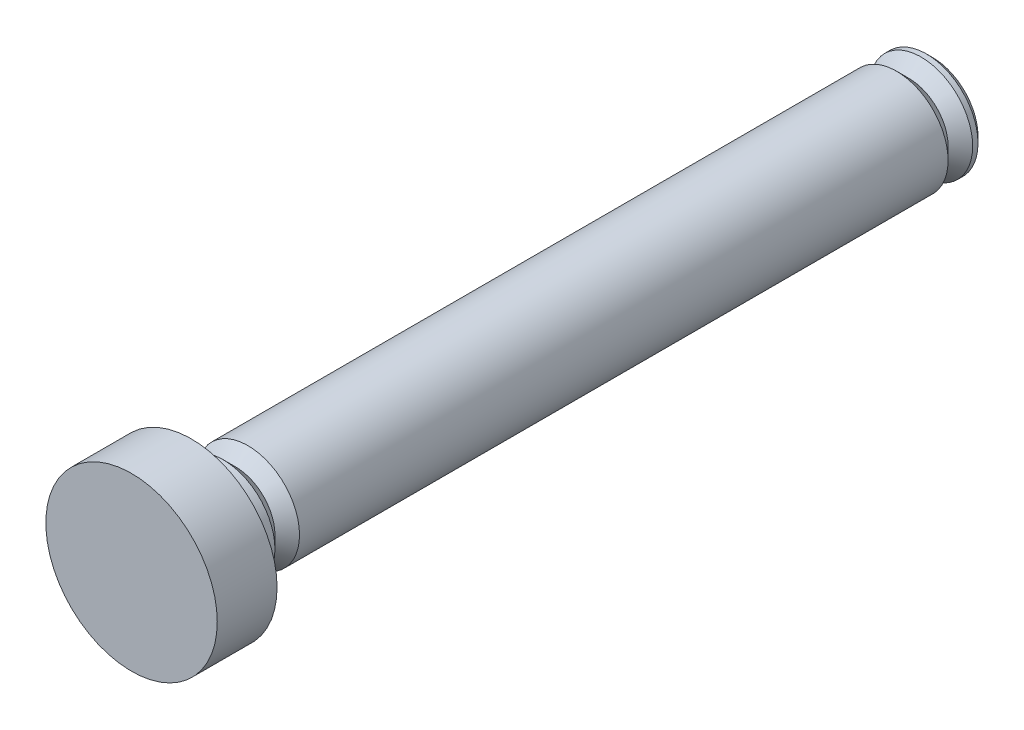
ISO-10303-21;
HEADER;
FILE_DESCRIPTION(('STEP AP214'),'2;1');
FILE_NAME('part.step','',(''),(''),'','','');
FILE_SCHEMA(('AUTOMOTIVE_DESIGN { 1 0 10303 214 1 1 1 1 }'));
ENDSEC;
DATA;
#1=APPLICATION_CONTEXT('core data for automotive mechanical design processes');
#2=APPLICATION_PROTOCOL_DEFINITION('international standard','automotive_design',2000,#1);
#3=PRODUCT_CONTEXT('',#1,'mechanical');
#4=PRODUCT('Part','Part','',(#3));
#5=PRODUCT_RELATED_PRODUCT_CATEGORY('part','',(#4));
#6=PRODUCT_DEFINITION_FORMATION('','',#4);
#7=PRODUCT_DEFINITION_CONTEXT('part definition',#1,'design');
#8=PRODUCT_DEFINITION('design','',#6,#7);
#9=PRODUCT_DEFINITION_SHAPE('','',#8);
#10=(LENGTH_UNIT() NAMED_UNIT(*) SI_UNIT(.MILLI.,.METRE.));
#11=(NAMED_UNIT(*) PLANE_ANGLE_UNIT() SI_UNIT($,.RADIAN.));
#12=(NAMED_UNIT(*) SI_UNIT($,.STERADIAN.) SOLID_ANGLE_UNIT());
#13=UNCERTAINTY_MEASURE_WITH_UNIT(LENGTH_MEASURE(1.E-05),#10,'distance_accuracy_value','');
#14=(GEOMETRIC_REPRESENTATION_CONTEXT(3) GLOBAL_UNCERTAINTY_ASSIGNED_CONTEXT((#13)) GLOBAL_UNIT_ASSIGNED_CONTEXT((#10,
#11,#12)) REPRESENTATION_CONTEXT('',''));
#15=CARTESIAN_POINT('',(0.,0.,0.));
#16=DIRECTION('',(0.,0.,1.));
#17=DIRECTION('',(1.,0.,0.));
#18=AXIS2_PLACEMENT_3D('',#15,#16,#17);
#19=CARTESIAN_POINT('',(0.,0.,0.));
#20=DIRECTION('',(0.,0.,-1.));
#21=DIRECTION('',(-1.,0.,0.));
#22=AXIS2_PLACEMENT_3D('',#19,#20,#21);
#23=PLANE('',#22);
#24=CARTESIAN_POINT('',(0.,0.,0.));
#25=DIRECTION('',(0.,0.,1.));
#26=DIRECTION('',(1.,0.,0.));
#27=AXIS2_PLACEMENT_3D('',#24,#25,#26);
#28=CIRCLE('',#27,4.0767);
#29=CARTESIAN_POINT('',(4.0767,0.,0.));
#30=VERTEX_POINT('',#29);
#31=EDGE_CURVE('E10',#30,#30,#28,.T.);
#32=ORIENTED_EDGE('',*,*,#31,.T.);
#33=EDGE_LOOP('',(#32));
#34=FACE_BOUND('',#33,.T.);
#35=ADVANCED_FACE('F30',(#34),#23,.F.);
#36=CARTESIAN_POINT('',(0.,0.,0.));
#37=DIRECTION('',(0.,0.,1.));
#38=DIRECTION('',(1.,0.,0.));
#39=AXIS2_PLACEMENT_3D('',#36,#37,#38);
#40=CYLINDRICAL_SURFACE('',#39,4.0767);
#41=ORIENTED_EDGE('',*,*,#31,.F.);
#42=EDGE_LOOP('',(#41));
#43=FACE_BOUND('',#42,.T.);
#44=CARTESIAN_POINT('',(0.,0.,-2.8448));
#45=DIRECTION('',(0.,0.,1.));
#46=DIRECTION('',(1.,0.,0.));
#47=AXIS2_PLACEMENT_3D('',#44,#45,#46);
#48=CIRCLE('',#47,4.0767);
#49=CARTESIAN_POINT('',(4.0767,0.,-2.8448));
#50=VERTEX_POINT('',#49);
#51=EDGE_CURVE('E36',#50,#50,#48,.T.);
#52=ORIENTED_EDGE('',*,*,#51,.T.);
#53=EDGE_LOOP('',(#52));
#54=FACE_BOUND('',#53,.T.);
#55=ADVANCED_FACE('F83',(#43,#54),#40,.T.);
#56=CARTESIAN_POINT('',(0.,4.0767,-2.8448));
#57=DIRECTION('',(0.,0.,1.));
#58=DIRECTION('',(1.,0.,0.));
#59=AXIS2_PLACEMENT_3D('',#56,#57,#58);
#60=PLANE('',#59);
#61=ORIENTED_EDGE('',*,*,#51,.F.);
#62=EDGE_LOOP('',(#61));
#63=FACE_BOUND('',#62,.T.);
#64=CARTESIAN_POINT('',(0.,0.,-2.8448));
#65=DIRECTION('',(0.,0.,1.));
#66=DIRECTION('',(1.,0.,0.));
#67=AXIS2_PLACEMENT_3D('',#64,#65,#66);
#68=CIRCLE('',#67,2.4511);
#69=CARTESIAN_POINT('',(2.4511,0.,-2.8448));
#70=VERTEX_POINT('',#69);
#71=EDGE_CURVE('E40',#70,#70,#68,.T.);
#72=ORIENTED_EDGE('',*,*,#71,.T.);
#73=EDGE_LOOP('',(#72));
#74=FACE_BOUND('',#73,.T.);
#75=ADVANCED_FACE('F87',(#63,#74),#60,.F.);
#76=CARTESIAN_POINT('',(0.,0.,0.));
#77=DIRECTION('',(0.,0.,1.));
#78=DIRECTION('',(1.,0.,0.));
#79=AXIS2_PLACEMENT_3D('',#76,#77,#78);
#80=CYLINDRICAL_SURFACE('',#79,2.4511);
#81=ORIENTED_EDGE('',*,*,#71,.F.);
#82=EDGE_LOOP('',(#81));
#83=FACE_BOUND('',#82,.T.);
#84=CARTESIAN_POINT('',(0.,0.,-4.3688));
#85=DIRECTION('',(0.,0.,1.));
#86=DIRECTION('',(1.,0.,0.));
#87=AXIS2_PLACEMENT_3D('',#84,#85,#86);
#88=CIRCLE('',#87,2.4511);
#89=CARTESIAN_POINT('',(2.4511,0.,-4.3688));
#90=VERTEX_POINT('',#89);
#91=EDGE_CURVE('E44',#90,#90,#88,.T.);
#92=ORIENTED_EDGE('',*,*,#91,.T.);
#93=EDGE_LOOP('',(#92));
#94=FACE_BOUND('',#93,.T.);
#95=ADVANCED_FACE('F92',(#83,#94),#80,.T.);
#96=CARTESIAN_POINT('',(0.,0.,-4.95300000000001));
#97=DIRECTION('',(0.,0.,1.));
#98=DIRECTION('',(1.,0.,0.));
#99=AXIS2_PLACEMENT_3D('',#96,#97,#98);
#100=CONICAL_SURFACE('',#99,1.8669,0.785398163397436);
#101=ORIENTED_EDGE('',*,*,#91,.F.);
#102=EDGE_LOOP('',(#101));
#103=FACE_BOUND('',#102,.T.);
#104=CARTESIAN_POINT('',(0.,0.,-4.95300000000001));
#105=DIRECTION('',(0.,0.,1.));
#106=DIRECTION('',(1.,0.,0.));
#107=AXIS2_PLACEMENT_3D('',#104,#105,#106);
#108=CIRCLE('',#107,1.8669);
#109=CARTESIAN_POINT('',(1.8669,0.,-4.95300000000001));
#110=VERTEX_POINT('',#109);
#111=EDGE_CURVE('E49',#110,#110,#108,.T.);
#112=ORIENTED_EDGE('',*,*,#111,.T.);
#113=EDGE_LOOP('',(#112));
#114=FACE_BOUND('',#113,.T.);
#115=ADVANCED_FACE('F98',(#103,#114),#100,.T.);
#116=CARTESIAN_POINT('',(0.,0.,-5.53720000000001));
#117=DIRECTION('',(0.,0.,-1.));
#118=DIRECTION('',(-1.,0.,0.));
#119=AXIS2_PLACEMENT_3D('',#116,#117,#118);
#120=CONICAL_SURFACE('',#119,2.45110000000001,0.78539816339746);
#121=ORIENTED_EDGE('',*,*,#111,.F.);
#122=EDGE_LOOP('',(#121));
#123=FACE_BOUND('',#122,.T.);
#124=CARTESIAN_POINT('',(0.,0.,-5.53720000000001));
#125=DIRECTION('',(0.,0.,1.));
#126=DIRECTION('',(1.,0.,0.));
#127=AXIS2_PLACEMENT_3D('',#124,#125,#126);
#128=CIRCLE('',#127,2.45110000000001);
#129=CARTESIAN_POINT('',(2.45110000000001,0.,-5.53720000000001));
#130=VERTEX_POINT('',#129);
#131=EDGE_CURVE('E52',#130,#130,#128,.T.);
#132=ORIENTED_EDGE('',*,*,#131,.T.);
#133=EDGE_LOOP('',(#132));
#134=FACE_BOUND('',#133,.T.);
#135=ADVANCED_FACE('F102',(#123,#134),#120,.T.);
#136=CARTESIAN_POINT('',(0.,0.,0.));
#137=DIRECTION('',(0.,0.,1.));
#138=DIRECTION('',(1.,0.,0.));
#139=AXIS2_PLACEMENT_3D('',#136,#137,#138);
#140=CYLINDRICAL_SURFACE('',#139,2.45110000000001);
#141=ORIENTED_EDGE('',*,*,#131,.F.);
#142=EDGE_LOOP('',(#141));
#143=FACE_BOUND('',#142,.T.);
#144=CARTESIAN_POINT('',(0.,0.,-36.3855));
#145=DIRECTION('',(0.,0.,1.));
#146=DIRECTION('',(1.,0.,0.));
#147=AXIS2_PLACEMENT_3D('',#144,#145,#146);
#148=CIRCLE('',#147,2.45110000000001);
#149=CARTESIAN_POINT('',(2.45110000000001,0.,-36.3855));
#150=VERTEX_POINT('',#149);
#151=EDGE_CURVE('E55',#150,#150,#148,.T.);
#152=ORIENTED_EDGE('',*,*,#151,.T.);
#153=EDGE_LOOP('',(#152));
#154=FACE_BOUND('',#153,.T.);
#155=ADVANCED_FACE('F106',(#143,#154),#140,.T.);
#156=CARTESIAN_POINT('',(0.,0.,-36.9697));
#157=DIRECTION('',(0.,0.,1.));
#158=DIRECTION('',(1.,0.,0.));
#159=AXIS2_PLACEMENT_3D('',#156,#157,#158);
#160=CONICAL_SURFACE('',#159,1.8669,0.785398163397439);
#161=ORIENTED_EDGE('',*,*,#151,.F.);
#162=EDGE_LOOP('',(#161));
#163=FACE_BOUND('',#162,.T.);
#164=CARTESIAN_POINT('',(0.,0.,-36.9697));
#165=DIRECTION('',(0.,0.,1.));
#166=DIRECTION('',(1.,0.,0.));
#167=AXIS2_PLACEMENT_3D('',#164,#165,#166);
#168=CIRCLE('',#167,1.8669);
#169=CARTESIAN_POINT('',(1.8669,0.,-36.9697));
#170=VERTEX_POINT('',#169);
#171=EDGE_CURVE('E58',#170,#170,#168,.T.);
#172=ORIENTED_EDGE('',*,*,#171,.T.);
#173=EDGE_LOOP('',(#172));
#174=FACE_BOUND('',#173,.T.);
#175=ADVANCED_FACE('F110',(#163,#174),#160,.T.);
#176=CARTESIAN_POINT('',(0.,0.,-37.5539));
#177=DIRECTION('',(0.,0.,-1.));
#178=DIRECTION('',(-1.,0.,0.));
#179=AXIS2_PLACEMENT_3D('',#176,#177,#178);
#180=CONICAL_SURFACE('',#179,2.45110000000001,0.785398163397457);
#181=ORIENTED_EDGE('',*,*,#171,.F.);
#182=EDGE_LOOP('',(#181));
#183=FACE_BOUND('',#182,.T.);
#184=CARTESIAN_POINT('',(0.,0.,-37.5539));
#185=DIRECTION('',(0.,0.,1.));
#186=DIRECTION('',(1.,0.,0.));
#187=AXIS2_PLACEMENT_3D('',#184,#185,#186);
#188=CIRCLE('',#187,2.45110000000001);
#189=CARTESIAN_POINT('',(2.45110000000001,0.,-37.5539));
#190=VERTEX_POINT('',#189);
#191=EDGE_CURVE('E61',#190,#190,#188,.T.);
#192=ORIENTED_EDGE('',*,*,#191,.T.);
#193=EDGE_LOOP('',(#192));
#194=FACE_BOUND('',#193,.T.);
#195=ADVANCED_FACE('F114',(#183,#194),#180,.T.);
#196=CARTESIAN_POINT('',(0.,0.,0.));
#197=DIRECTION('',(0.,0.,1.));
#198=DIRECTION('',(1.,0.,0.));
#199=AXIS2_PLACEMENT_3D('',#196,#197,#198);
#200=CYLINDRICAL_SURFACE('',#199,2.45110000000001);
#201=ORIENTED_EDGE('',*,*,#191,.F.);
#202=EDGE_LOOP('',(#201));
#203=FACE_BOUND('',#202,.T.);
#204=CARTESIAN_POINT('',(0.,0.,-37.8079));
#205=DIRECTION('',(0.,0.,1.));
#206=DIRECTION('',(1.,0.,0.));
#207=AXIS2_PLACEMENT_3D('',#204,#205,#206);
#208=CIRCLE('',#207,2.45110000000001);
#209=CARTESIAN_POINT('',(2.45110000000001,0.,-37.8079));
#210=VERTEX_POINT('',#209);
#211=EDGE_CURVE('E64',#210,#210,#208,.T.);
#212=ORIENTED_EDGE('',*,*,#211,.T.);
#213=EDGE_LOOP('',(#212));
#214=FACE_BOUND('',#213,.T.);
#215=ADVANCED_FACE('F79',(#203,#214),#200,.T.);
#216=CARTESIAN_POINT('',(0.,0.,-38.1));
#217=DIRECTION('',(0.,0.,1.));
#218=DIRECTION('',(1.,0.,0.));
#219=AXIS2_PLACEMENT_3D('',#216,#217,#218);
#220=CONICAL_SURFACE('',#219,2.159,0.785398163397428);
#221=ORIENTED_EDGE('',*,*,#211,.F.);
#222=EDGE_LOOP('',(#221));
#223=FACE_BOUND('',#222,.T.);
#224=CARTESIAN_POINT('',(0.,0.,-38.1));
#225=DIRECTION('',(0.,0.,1.));
#226=DIRECTION('',(1.,0.,0.));
#227=AXIS2_PLACEMENT_3D('',#224,#225,#226);
#228=CIRCLE('',#227,2.159);
#229=CARTESIAN_POINT('',(2.159,0.,-38.1));
#230=VERTEX_POINT('',#229);
#231=EDGE_CURVE('E67',#230,#230,#228,.T.);
#232=ORIENTED_EDGE('',*,*,#231,.T.);
#233=EDGE_LOOP('',(#232));
#234=FACE_BOUND('',#233,.T.);
#235=ADVANCED_FACE('F71',(#223,#234),#220,.T.);
#236=CARTESIAN_POINT('',(0.,2.159,-38.1));
#237=DIRECTION('',(0.,0.,1.));
#238=DIRECTION('',(1.,0.,0.));
#239=AXIS2_PLACEMENT_3D('',#236,#237,#238);
#240=PLANE('',#239);
#241=ORIENTED_EDGE('',*,*,#231,.F.);
#242=EDGE_LOOP('',(#241));
#243=FACE_BOUND('',#242,.T.);
#244=ADVANCED_FACE('F73',(#243),#240,.F.);
#245=CLOSED_SHELL('',(#35,#55,#75,#95,#115,#135,#155,#175,#195,#215,#235,#244));
#246=MANIFOLD_SOLID_BREP('B2',#245);
#247=ADVANCED_BREP_SHAPE_REPRESENTATION('',(#18,#246),#14);
#248=SHAPE_DEFINITION_REPRESENTATION(#9,#247);
ENDSEC;
END-ISO-10303-21;
